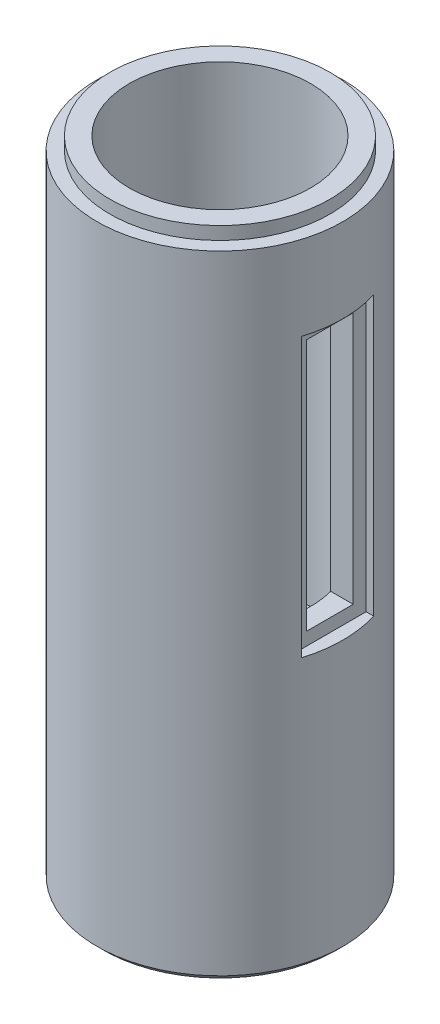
from build123d import *

# Parameters (mm, degrees)
CHAMFER2_SIZE           = 1
CUT_EXTRUDE1_REACH      = 110.651
CUT_EXTRUDE1_END_RADIUS = 14
SKETCH2_R               = 10
CUT_EXTRUDE3_REACH      = 110.651
CUT_EXTRUDE3_END_RADIUS = 14
SKETCH3_W               = 7.175
SKETCH3_H               = 39
SKETCH4_W               = 11.175
SKETCH4_H               = 43
CUT_EXTRUDE4_DEPTH      = 2
SKETCH5_W               = 2
SKETCH5_H               = 2


with BuildPart() as part:
    # Sketch1 → Revolve2 (revolve)
    with BuildSketch(Plane.XY, mode=Mode.PRIVATE) as revolve2_sk:
        Polygon((-13, 0), (-13, 20), (-14, 20), (-14, 0), (-19, 0), (-19, 100), (0, 100), (-14, 100), (-14, 30), (-10, 30), (-10, 0), align=None)
    revolve(revolve2_sk.sketch.rotate(Axis((0, 0, 0), (0, 1, 0)), 270), axis=Axis((0, 0, 0), (0, 1, 0)))

    # Chamfer2
    chamfer2_edges = [part.edges().sort_by_distance(p)[0] for p in [
        (0, 0, 19),
    ]]
    chamfer(chamfer2_edges, length=CHAMFER2_SIZE)

    # Cut-Extrude1: up to this cylinder (the profile starts outside it)
    cut_extrude1_end = Plane(origin=(0, 50, 0), z_dir=(0, -1, 0)) * Cylinder(CUT_EXTRUDE1_END_RADIUS, 250.302, mode=Mode.PRIVATE)
    # Sketch2 → Cut-Extrude1 (cut, up to the surface)
    with BuildSketch(Plane.ZY.offset(19), mode=Mode.PRIVATE) as cut_extrude1_sk1:
        with Locations((0, 50)):
            Circle(SKETCH2_R)
    cut_extrude1_tool1 = extrude(cut_extrude1_sk1.sketch, amount=-CUT_EXTRUDE1_REACH, mode=Mode.PRIVATE) - cut_extrude1_end
    add(cut_extrude1_tool1.solids().sort_by_distance((-19, 50, 0))[0], mode=Mode.SUBTRACT)

    # Cut-Extrude3: up to this cylinder (the profile starts outside it)
    cut_extrude3_end = Plane(origin=(0, 63.5, 0), z_dir=(0, -1, 0)) * Cylinder(CUT_EXTRUDE3_END_RADIUS, 250.302, mode=Mode.PRIVATE)
    # Sketch3 → Cut-Extrude3 (cut, up to the surface)
    with BuildSketch(Plane(origin=(19, 0, 0), x_dir=(0, 0, -1), z_dir=(1, 0, 0)), mode=Mode.PRIVATE) as cut_extrude3_sk1:
        with Locations((0, 63.5)):
            Rectangle(SKETCH3_W, SKETCH3_H)
    cut_extrude3_tool1 = extrude(cut_extrude3_sk1.sketch, amount=-CUT_EXTRUDE3_REACH, mode=Mode.PRIVATE) - cut_extrude3_end
    add(cut_extrude3_tool1.solids().sort_by_distance((19, 63.5, 0))[0], mode=Mode.SUBTRACT)

    # Sketch4 → Cut-Extrude4 (cut)
    with BuildSketch(Plane(origin=(19, 0, 0), x_dir=(0, 0, -1), z_dir=(1, 0, 0))):
        with Locations((0, 63.5)):
            Rectangle(SKETCH4_W, SKETCH4_H)
    extrude(amount=-CUT_EXTRUDE4_DEPTH, mode=Mode.SUBTRACT)

    # Sketch5 → Cut-Revolve1 (revolve, cut)
    with BuildSketch(Plane.XY, mode=Mode.PRIVATE) as cut_revolve1_sk:
        with Locations((-18, 99)):
            Rectangle(SKETCH5_W, SKETCH5_H)
    revolve(cut_revolve1_sk.sketch.rotate(Axis((0, 0, 0), (0, -1, 0)), 90), axis=Axis((0, 0, 0), (0, -1, 0)), mode=Mode.SUBTRACT)


solid = part.part
